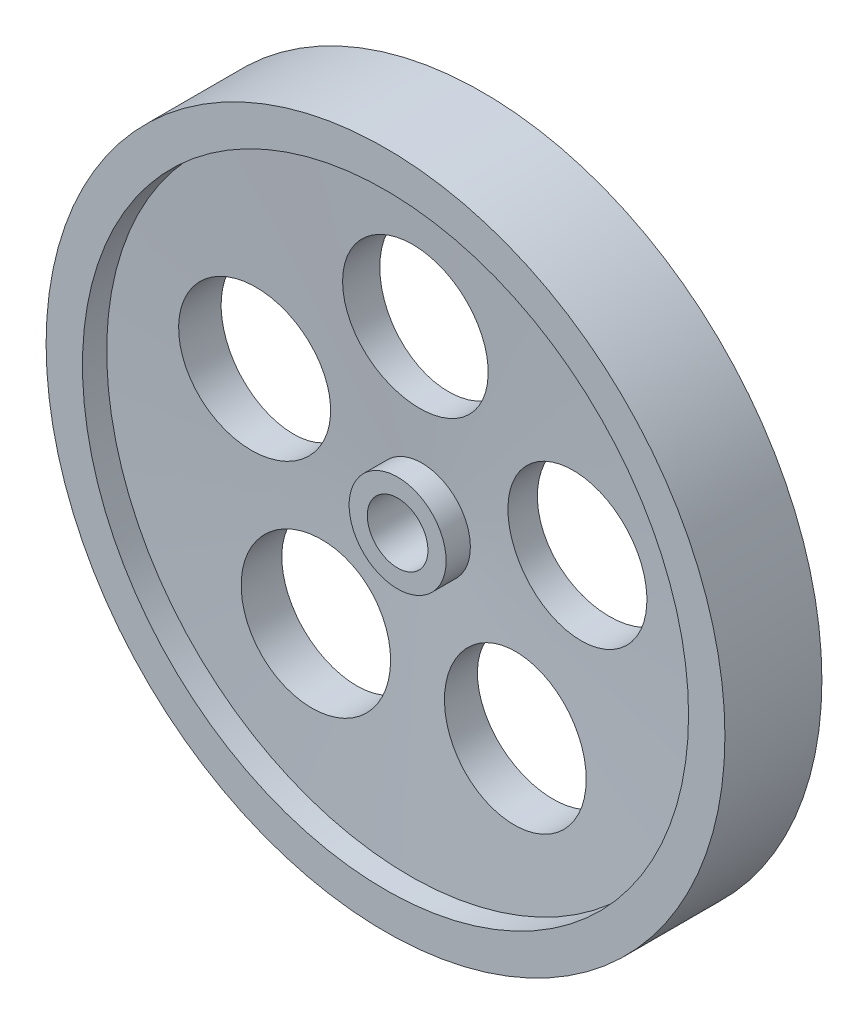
from build123d import *

# Parameters (mm, degrees)
CIRCULAR_CUT_SKETCH_R = 38.1
CUT_EXTRUDE1_DEPTH    = 253.726809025
CIRCLE_PATTERN_COUNT  = 5


with BuildPart() as part:
    # Sketch1 → Revolve1 (revolve)
    with BuildSketch(Plane(origin=(0, 0, 0), x_dir=(0, 0, -1), z_dir=(1, 0, 0)), mode=Mode.PRIVATE) as revolve1_sk:
        Polygon((-19.05, 15.875), (-19.05, 25.4), (-6.35, 25.4), (-12.7, 158.75), (-25.4, 158.75), (-25.4, 177.8), (25.4, 177.8), (25.4, 158.75), (12.7, 158.75), (6.35, 25.4), (19.05, 25.4), (19.05, 15.875), align=None)
    revolve(revolve1_sk.sketch.rotate(Axis((0, 0, 22.151421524), (0, 0, -1)), 90), axis=Axis((0, 0, 22.151421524), (0, 0, -1)))

    # Circular Cut Sketch → Cut-Extrude1 (cut, symmetric)
    with BuildSketch(Plane.XY):
        with Locations(Location((0, 88.9, 0), (0, 0, 224.921566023))):
            Circle(CIRCULAR_CUT_SKETCH_R)
    cut_extrude1 = extrude(amount=CUT_EXTRUDE1_DEPTH, both=True, mode=Mode.SUBTRACT)

    # Circle Pattern: Cut-Extrude1 ×5 about axis
    circle_pattern_axis = Axis((0, 0, 0), (0, 0, 1))
    for i in range(1, CIRCLE_PATTERN_COUNT):
        add(cut_extrude1.rotate(circle_pattern_axis, i * 360 / CIRCLE_PATTERN_COUNT), mode=Mode.SUBTRACT)


solid = part.part
